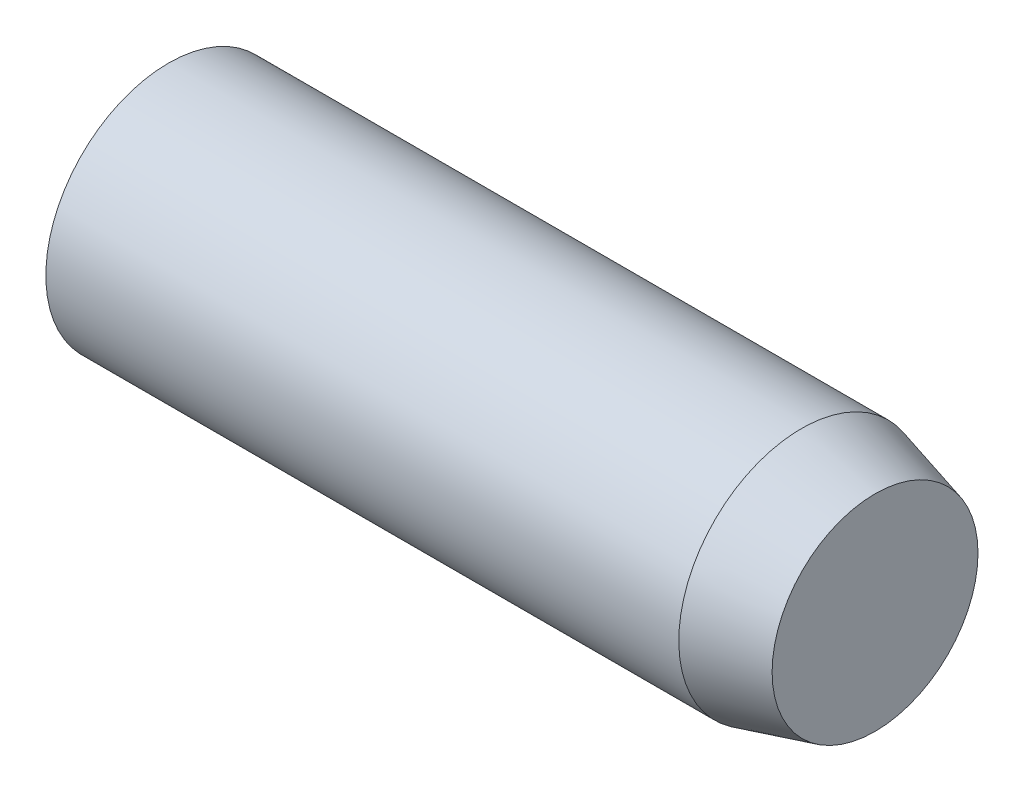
ISO-10303-21;
HEADER;
FILE_DESCRIPTION(('STEP AP214'),'2;1');
FILE_NAME('part.step','',(''),(''),'','','');
FILE_SCHEMA(('AUTOMOTIVE_DESIGN { 1 0 10303 214 1 1 1 1 }'));
ENDSEC;
DATA;
#1=APPLICATION_CONTEXT('core data for automotive mechanical design processes');
#2=APPLICATION_PROTOCOL_DEFINITION('international standard','automotive_design',2000,#1);
#3=PRODUCT_CONTEXT('',#1,'mechanical');
#4=PRODUCT('Part','Part','',(#3));
#5=PRODUCT_RELATED_PRODUCT_CATEGORY('part','',(#4));
#6=PRODUCT_DEFINITION_FORMATION('','',#4);
#7=PRODUCT_DEFINITION_CONTEXT('part definition',#1,'design');
#8=PRODUCT_DEFINITION('design','',#6,#7);
#9=PRODUCT_DEFINITION_SHAPE('','',#8);
#10=(LENGTH_UNIT() NAMED_UNIT(*) SI_UNIT(.MILLI.,.METRE.));
#11=(NAMED_UNIT(*) PLANE_ANGLE_UNIT() SI_UNIT($,.RADIAN.));
#12=(NAMED_UNIT(*) SI_UNIT($,.STERADIAN.) SOLID_ANGLE_UNIT());
#13=UNCERTAINTY_MEASURE_WITH_UNIT(LENGTH_MEASURE(1.E-05),#10,'distance_accuracy_value','');
#14=(GEOMETRIC_REPRESENTATION_CONTEXT(3) GLOBAL_UNCERTAINTY_ASSIGNED_CONTEXT((#13)) GLOBAL_UNIT_ASSIGNED_CONTEXT((#10,
#11,#12)) REPRESENTATION_CONTEXT('',''));
#15=CARTESIAN_POINT('',(0.,0.,0.));
#16=DIRECTION('',(0.,0.,1.));
#17=DIRECTION('',(1.,0.,0.));
#18=AXIS2_PLACEMENT_3D('',#15,#16,#17);
#19=CARTESIAN_POINT('',(30.,4.19615242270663,0.));
#20=DIRECTION('',(-1.,0.,0.));
#21=DIRECTION('',(0.,-1.,0.));
#22=AXIS2_PLACEMENT_3D('',#19,#20,#21);
#23=PLANE('',#22);
#24=CARTESIAN_POINT('',(30.,0.,0.));
#25=DIRECTION('',(-1.,0.,0.));
#26=DIRECTION('',(0.,-1.,0.));
#27=AXIS2_PLACEMENT_3D('',#24,#25,#26);
#28=CIRCLE('',#27,4.19615242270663);
#29=CARTESIAN_POINT('',(30.,-4.19615242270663,0.));
#30=VERTEX_POINT('',#29);
#31=EDGE_CURVE('E10',#30,#30,#28,.T.);
#32=ORIENTED_EDGE('',*,*,#31,.F.);
#33=EDGE_LOOP('',(#32));
#34=FACE_BOUND('',#33,.T.);
#35=ADVANCED_FACE('F40',(#34),#23,.F.);
#36=CARTESIAN_POINT('',(30.,0.,0.));
#37=DIRECTION('',(-1.,0.,0.));
#38=DIRECTION('',(0.,-1.,0.));
#39=AXIS2_PLACEMENT_3D('',#36,#37,#38);
#40=CONICAL_SURFACE('',#39,4.19615242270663,0.26179938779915);
#41=CARTESIAN_POINT('',(27.,0.,0.));
#42=DIRECTION('',(-1.,0.,0.));
#43=DIRECTION('',(0.,-1.,0.));
#44=AXIS2_PLACEMENT_3D('',#41,#42,#43);
#45=CIRCLE('',#44,5.);
#46=CARTESIAN_POINT('',(27.,-5.,0.));
#47=VERTEX_POINT('',#46);
#48=EDGE_CURVE('E43',#47,#47,#45,.T.);
#49=ORIENTED_EDGE('',*,*,#48,.F.);
#50=EDGE_LOOP('',(#49));
#51=FACE_BOUND('',#50,.T.);
#52=ORIENTED_EDGE('',*,*,#31,.T.);
#53=EDGE_LOOP('',(#52));
#54=FACE_BOUND('',#53,.T.);
#55=ADVANCED_FACE('F59',(#51,#54),#40,.T.);
#56=CARTESIAN_POINT('',(0.,0.,0.));
#57=DIRECTION('',(-1.,0.,0.));
#58=DIRECTION('',(0.,-1.,0.));
#59=AXIS2_PLACEMENT_3D('',#56,#57,#58);
#60=CYLINDRICAL_SURFACE('',#59,5.);
#61=CARTESIAN_POINT('',(1.2,0.,0.));
#62=DIRECTION('',(-1.,0.,0.));
#63=DIRECTION('',(0.,-1.,0.));
#64=AXIS2_PLACEMENT_3D('',#61,#62,#63);
#65=CIRCLE('',#64,5.);
#66=CARTESIAN_POINT('',(1.2,-5.,0.));
#67=VERTEX_POINT('',#66);
#68=EDGE_CURVE('E50',#67,#67,#65,.T.);
#69=ORIENTED_EDGE('',*,*,#68,.F.);
#70=EDGE_LOOP('',(#69));
#71=FACE_BOUND('',#70,.T.);
#72=ORIENTED_EDGE('',*,*,#48,.T.);
#73=EDGE_LOOP('',(#72));
#74=FACE_BOUND('',#73,.T.);
#75=ADVANCED_FACE('F57',(#71,#74),#60,.T.);
#76=CARTESIAN_POINT('',(11.0166666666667,0.,0.));
#77=DIRECTION('',(-1.,0.,0.));
#78=DIRECTION('',(0.,1.,0.));
#79=AXIS2_PLACEMENT_3D('',#76,#77,#78);
#80=SPHERICAL_SURFACE('',#79,11.0166666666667);
#81=ORIENTED_EDGE('',*,*,#68,.T.);
#82=EDGE_LOOP('',(#81));
#83=FACE_BOUND('',#82,.T.);
#84=ADVANCED_FACE('F53',(#83),#80,.T.);
#85=CLOSED_SHELL('',(#35,#55,#75,#84));
#86=MANIFOLD_SOLID_BREP('B2',#85);
#87=ADVANCED_BREP_SHAPE_REPRESENTATION('',(#18,#86),#14);
#88=SHAPE_DEFINITION_REPRESENTATION(#9,#87);
ENDSEC;
END-ISO-10303-21;
